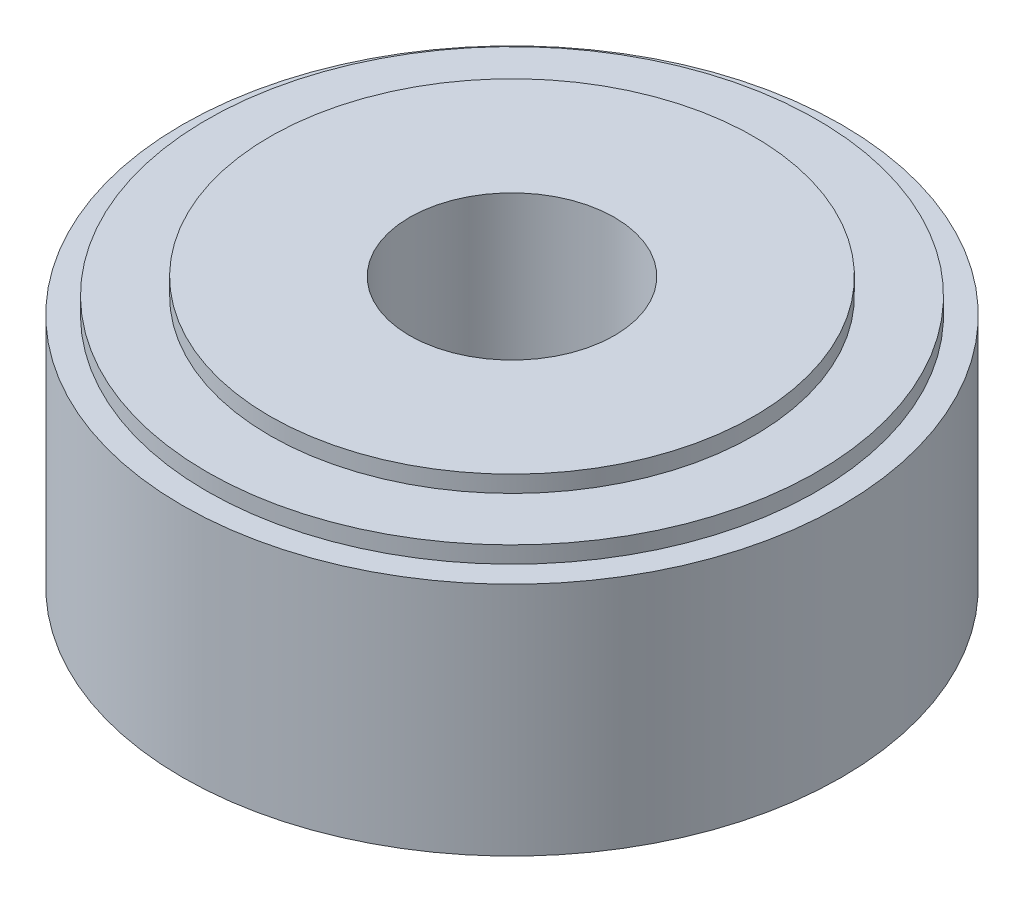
ISO-10303-21;
HEADER;
FILE_DESCRIPTION(('STEP AP214'),'2;1');
FILE_NAME('part.step','',(''),(''),'','','');
FILE_SCHEMA(('AUTOMOTIVE_DESIGN { 1 0 10303 214 1 1 1 1 }'));
ENDSEC;
DATA;
#1=APPLICATION_CONTEXT('core data for automotive mechanical design processes');
#2=APPLICATION_PROTOCOL_DEFINITION('international standard','automotive_design',2000,#1);
#3=PRODUCT_CONTEXT('',#1,'mechanical');
#4=PRODUCT('Part','Part','',(#3));
#5=PRODUCT_RELATED_PRODUCT_CATEGORY('part','',(#4));
#6=PRODUCT_DEFINITION_FORMATION('','',#4);
#7=PRODUCT_DEFINITION_CONTEXT('part definition',#1,'design');
#8=PRODUCT_DEFINITION('design','',#6,#7);
#9=PRODUCT_DEFINITION_SHAPE('','',#8);
#10=(LENGTH_UNIT() NAMED_UNIT(*) SI_UNIT(.MILLI.,.METRE.));
#11=(NAMED_UNIT(*) PLANE_ANGLE_UNIT() SI_UNIT($,.RADIAN.));
#12=(NAMED_UNIT(*) SI_UNIT($,.STERADIAN.) SOLID_ANGLE_UNIT());
#13=UNCERTAINTY_MEASURE_WITH_UNIT(LENGTH_MEASURE(1.E-05),#10,'distance_accuracy_value','');
#14=(GEOMETRIC_REPRESENTATION_CONTEXT(3) GLOBAL_UNCERTAINTY_ASSIGNED_CONTEXT((#13)) GLOBAL_UNIT_ASSIGNED_CONTEXT((#10,
#11,#12)) REPRESENTATION_CONTEXT('',''));
#15=CARTESIAN_POINT('',(0.,0.,0.));
#16=DIRECTION('',(0.,0.,1.));
#17=DIRECTION('',(1.,0.,0.));
#18=AXIS2_PLACEMENT_3D('',#15,#16,#17);
#19=CARTESIAN_POINT('',(0.,7.045,0.));
#20=DIRECTION('',(0.,-1.,0.));
#21=DIRECTION('',(0.,0.,-1.));
#22=AXIS2_PLACEMENT_3D('',#19,#20,#21);
#23=CYLINDRICAL_SURFACE('',#22,19.73);
#24=CARTESIAN_POINT('',(0.,7.045,0.));
#25=DIRECTION('',(0.,1.,0.));
#26=DIRECTION('',(0.,0.,1.));
#27=AXIS2_PLACEMENT_3D('',#24,#25,#26);
#28=CIRCLE('',#27,19.73);
#29=CARTESIAN_POINT('',(0.,7.045,19.73));
#30=VERTEX_POINT('',#29);
#31=EDGE_CURVE('E10',#30,#30,#28,.T.);
#32=ORIENTED_EDGE('',*,*,#31,.F.);
#33=EDGE_LOOP('',(#32));
#34=FACE_BOUND('',#33,.T.);
#35=CARTESIAN_POINT('',(0.,-7.045,0.));
#36=DIRECTION('',(0.,1.,0.));
#37=DIRECTION('',(0.,0.,1.));
#38=AXIS2_PLACEMENT_3D('',#35,#36,#37);
#39=CIRCLE('',#38,19.73);
#40=CARTESIAN_POINT('',(0.,-7.045,19.73));
#41=VERTEX_POINT('',#40);
#42=EDGE_CURVE('E53',#41,#41,#39,.T.);
#43=ORIENTED_EDGE('',*,*,#42,.T.);
#44=EDGE_LOOP('',(#43));
#45=FACE_BOUND('',#44,.T.);
#46=ADVANCED_FACE('F45',(#34,#45),#23,.T.);
#47=CARTESIAN_POINT('',(0.,7.045,0.));
#48=DIRECTION('',(0.,1.,0.));
#49=DIRECTION('',(0.,0.,1.));
#50=AXIS2_PLACEMENT_3D('',#47,#48,#49);
#51=PLANE('',#50);
#52=CARTESIAN_POINT('',(0.,7.045,0.));
#53=DIRECTION('',(0.,1.,0.));
#54=DIRECTION('',(0.,0.,1.));
#55=AXIS2_PLACEMENT_3D('',#52,#53,#54);
#56=CIRCLE('',#55,18.26);
#57=CARTESIAN_POINT('',(0.,7.045,18.26));
#58=VERTEX_POINT('',#57);
#59=EDGE_CURVE('E59',#58,#58,#56,.F.);
#60=ORIENTED_EDGE('',*,*,#59,.T.);
#61=EDGE_LOOP('',(#60));
#62=FACE_BOUND('',#61,.T.);
#63=ORIENTED_EDGE('',*,*,#31,.T.);
#64=EDGE_LOOP('',(#63));
#65=FACE_BOUND('',#64,.T.);
#66=ADVANCED_FACE('F108',(#62,#65),#51,.T.);
#67=CARTESIAN_POINT('',(0.,-7.045,0.));
#68=DIRECTION('',(0.,1.,0.));
#69=DIRECTION('',(0.,0.,1.));
#70=AXIS2_PLACEMENT_3D('',#67,#68,#69);
#71=PLANE('',#70);
#72=CARTESIAN_POINT('',(0.,-7.045,0.));
#73=DIRECTION('',(0.,1.,0.));
#74=DIRECTION('',(0.,0.,1.));
#75=AXIS2_PLACEMENT_3D('',#72,#73,#74);
#76=CIRCLE('',#75,6.13);
#77=CARTESIAN_POINT('',(0.,-7.045,6.13));
#78=VERTEX_POINT('',#77);
#79=EDGE_CURVE('E79',#78,#78,#76,.F.);
#80=ORIENTED_EDGE('',*,*,#79,.F.);
#81=EDGE_LOOP('',(#80));
#82=FACE_BOUND('',#81,.T.);
#83=ORIENTED_EDGE('',*,*,#42,.F.);
#84=EDGE_LOOP('',(#83));
#85=FACE_BOUND('',#84,.T.);
#86=ADVANCED_FACE('F112',(#82,#85),#71,.F.);
#87=CARTESIAN_POINT('',(0.,8.045,0.));
#88=DIRECTION('',(0.,-1.,0.));
#89=DIRECTION('',(0.,0.,-1.));
#90=AXIS2_PLACEMENT_3D('',#87,#88,#89);
#91=CYLINDRICAL_SURFACE('',#90,18.26);
#92=ORIENTED_EDGE('',*,*,#59,.F.);
#93=EDGE_LOOP('',(#92));
#94=FACE_BOUND('',#93,.T.);
#95=CARTESIAN_POINT('',(0.,8.045,0.));
#96=DIRECTION('',(0.,1.,0.));
#97=DIRECTION('',(0.,0.,1.));
#98=AXIS2_PLACEMENT_3D('',#95,#96,#97);
#99=CIRCLE('',#98,18.26);
#100=CARTESIAN_POINT('',(0.,8.045,18.26));
#101=VERTEX_POINT('',#100);
#102=EDGE_CURVE('E62',#101,#101,#99,.T.);
#103=ORIENTED_EDGE('',*,*,#102,.F.);
#104=EDGE_LOOP('',(#103));
#105=FACE_BOUND('',#104,.T.);
#106=ADVANCED_FACE('F118',(#94,#105),#91,.T.);
#107=CARTESIAN_POINT('',(0.,8.045,0.));
#108=DIRECTION('',(0.,1.,0.));
#109=DIRECTION('',(0.,0.,1.));
#110=AXIS2_PLACEMENT_3D('',#107,#108,#109);
#111=PLANE('',#110);
#112=CARTESIAN_POINT('',(0.,8.045,0.));
#113=DIRECTION('',(0.,1.,0.));
#114=DIRECTION('',(0.,0.,1.));
#115=AXIS2_PLACEMENT_3D('',#112,#113,#114);
#116=CIRCLE('',#115,14.49);
#117=CARTESIAN_POINT('',(0.,8.045,14.49));
#118=VERTEX_POINT('',#117);
#119=EDGE_CURVE('E48',#118,#118,#116,.F.);
#120=ORIENTED_EDGE('',*,*,#119,.T.);
#121=EDGE_LOOP('',(#120));
#122=FACE_BOUND('',#121,.T.);
#123=ORIENTED_EDGE('',*,*,#102,.T.);
#124=EDGE_LOOP('',(#123));
#125=FACE_BOUND('',#124,.T.);
#126=ADVANCED_FACE('F104',(#122,#125),#111,.T.);
#127=CARTESIAN_POINT('',(0.,9.045,0.));
#128=DIRECTION('',(0.,-1.,0.));
#129=DIRECTION('',(0.,0.,-1.));
#130=AXIS2_PLACEMENT_3D('',#127,#128,#129);
#131=CYLINDRICAL_SURFACE('',#130,14.49);
#132=ORIENTED_EDGE('',*,*,#119,.F.);
#133=EDGE_LOOP('',(#132));
#134=FACE_BOUND('',#133,.T.);
#135=CARTESIAN_POINT('',(0.,9.045,0.));
#136=DIRECTION('',(0.,1.,0.));
#137=DIRECTION('',(0.,0.,1.));
#138=AXIS2_PLACEMENT_3D('',#135,#136,#137);
#139=CIRCLE('',#138,14.49);
#140=CARTESIAN_POINT('',(0.,9.045,14.49));
#141=VERTEX_POINT('',#140);
#142=EDGE_CURVE('E74',#141,#141,#139,.T.);
#143=ORIENTED_EDGE('',*,*,#142,.F.);
#144=EDGE_LOOP('',(#143));
#145=FACE_BOUND('',#144,.T.);
#146=ADVANCED_FACE('F96',(#134,#145),#131,.T.);
#147=CARTESIAN_POINT('',(0.,9.045,0.));
#148=DIRECTION('',(0.,1.,0.));
#149=DIRECTION('',(0.,0.,1.));
#150=AXIS2_PLACEMENT_3D('',#147,#148,#149);
#151=PLANE('',#150);
#152=CARTESIAN_POINT('',(0.,9.045,0.));
#153=DIRECTION('',(0.,1.,0.));
#154=DIRECTION('',(0.,0.,1.));
#155=AXIS2_PLACEMENT_3D('',#152,#153,#154);
#156=CIRCLE('',#155,6.13);
#157=CARTESIAN_POINT('',(0.,9.045,6.13));
#158=VERTEX_POINT('',#157);
#159=EDGE_CURVE('E84',#158,#158,#156,.T.);
#160=ORIENTED_EDGE('',*,*,#159,.F.);
#161=EDGE_LOOP('',(#160));
#162=FACE_BOUND('',#161,.T.);
#163=ORIENTED_EDGE('',*,*,#142,.T.);
#164=EDGE_LOOP('',(#163));
#165=FACE_BOUND('',#164,.T.);
#166=ADVANCED_FACE('F94',(#162,#165),#151,.T.);
#167=CARTESIAN_POINT('',(0.,-7.046,0.));
#168=DIRECTION('',(0.,1.,0.));
#169=DIRECTION('',(0.,0.,1.));
#170=AXIS2_PLACEMENT_3D('',#167,#168,#169);
#171=CYLINDRICAL_SURFACE('',#170,6.13);
#172=ORIENTED_EDGE('',*,*,#159,.T.);
#173=EDGE_LOOP('',(#172));
#174=FACE_BOUND('',#173,.T.);
#175=ORIENTED_EDGE('',*,*,#79,.T.);
#176=EDGE_LOOP('',(#175));
#177=FACE_BOUND('',#176,.T.);
#178=ADVANCED_FACE('F91',(#174,#177),#171,.F.);
#179=CLOSED_SHELL('',(#46,#66,#86,#106,#126,#146,#166,#178));
#180=MANIFOLD_SOLID_BREP('B2',#179);
#181=ADVANCED_BREP_SHAPE_REPRESENTATION('',(#18,#180),#14);
#182=SHAPE_DEFINITION_REPRESENTATION(#9,#181);
ENDSEC;
END-ISO-10303-21;
